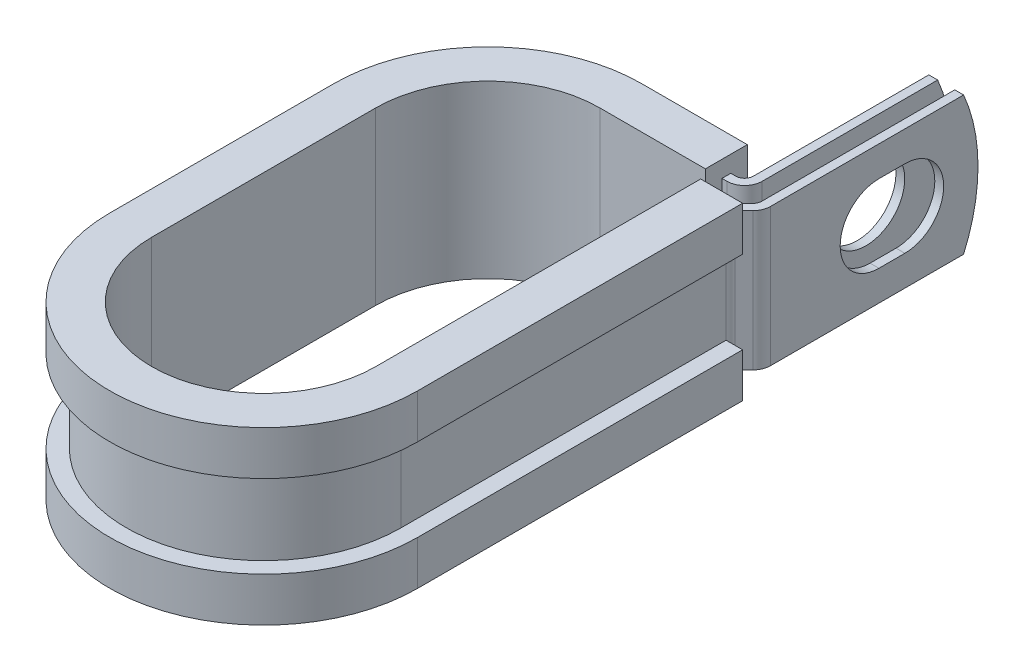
from build123d import *

# Parameters (mm, degrees)
EXTRUDE_THIN1_DEPTH = 6.35
SKETCH2_R           = 3.5687
CUT_EXTRUDE1_DEPTH  = 0.8128
CUT_EXTRUDE2_DEPTH  = 0.8128
CUT_EXTRUDE3_DEPTH  = 42.306831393


with BuildPart() as part:
    # Sketch1 → Extrude-Thin1 (new, symmetric)
    with BuildSketch(Plane(origin=(0, 0, 0), x_dir=(1, 0, 0), z_dir=(0, 1, 0))):
        with BuildLine():
            Line((13.376774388, 30.9372), (13.376774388, 11.8364))
            ThreePointArc((13.376774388, 11.8364), (13.314903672, 11.525354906), (13.13871078, 11.261663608))
            Line((13.13871078, 11.261663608), (12.312527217, 10.435480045))
            ThreePointArc((12.312527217, 10.435480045), (11.960141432, 9.908097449), (11.8364, 9.286007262))
            Line((11.8364, 9.286007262), (11.8364, 0))
            Line((11.8364, 0), (11.8364, -20.6248))
            ThreePointArc((11.8364, -20.6248), (0, -32.4612), (-11.8364, -20.6248))
            Line((-11.8364, -20.6248), (-11.8364, 0))
            ThreePointArc((-11.8364, 0), (-8.369598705, 8.369598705), (0, 11.8364))
            Line((0, 11.8364), (10.176374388, 11.8364))
            ThreePointArc((10.176374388, 11.8364), (11.325847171, 12.312527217), (11.801974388, 13.462))
            Line((11.801974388, 13.462), (11.801974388, 30.9372))
            Line((11.801974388, 30.9372), (10.989174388, 30.9372))
            Line((10.989174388, 30.9372), (10.989174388, 13.462))
            ThreePointArc((10.989174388, 13.462), (10.75111078, 12.887263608), (10.176374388, 12.6492))
            Line((10.176374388, 12.6492), (0, 12.6492))
            ThreePointArc((0, 12.6492), (-8.944335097, 8.944335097), (-12.6492, 0))
            Line((-12.6492, 0), (-12.6492, -20.6248))
            ThreePointArc((-12.6492, -20.6248), (0, -33.274), (12.6492, -20.6248))
            Line((12.6492, -20.6248), (12.6492, 0))
            Line((12.6492, 0), (12.6492, 9.286007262))
            ThreePointArc((12.6492, 9.286007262), (12.711070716, 9.597052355), (12.887263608, 9.860743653))
            Line((12.887263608, 9.860743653), (13.713447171, 10.686927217))
            ThreePointArc((13.713447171, 10.686927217), (14.065832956, 11.214309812), (14.189574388, 11.8364))
            Line((14.189574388, 11.8364), (14.189574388, 30.9372))
            Line((14.189574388, 30.9372), (13.376774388, 30.9372))
        make_face()
    extrude(amount=EXTRUDE_THIN1_DEPTH, both=True)

    # Sketch2 → Cut-Extrude1 (cut)
    with BuildSketch(Plane.ZY.offset(-10.989174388)):
        with Locations((-23.0124, 0)):
            Circle(SKETCH2_R)
    extrude(amount=-CUT_EXTRUDE1_DEPTH, mode=Mode.SUBTRACT)

    # Sketch3 → Cut-Extrude2 (cut)
    with BuildSketch(Plane(origin=(14.189574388, 0, 0), x_dir=(0, 0, -1), z_dir=(1, 0, 0))):
        with BuildLine():
            Line((21.8186, 3.5687), (24.2062, 3.5687))
            ThreePointArc((24.2062, 3.5687), (27.7749, 0), (24.2062, -3.5687))
            Line((24.2062, -3.5687), (21.8186, -3.5687))
            ThreePointArc((21.8186, -3.5687), (18.2499, 0), (21.8186, 3.5687))
        make_face()
    extrude(amount=-CUT_EXTRUDE2_DEPTH, mode=Mode.SUBTRACT)

    # Sketch4 → Cut-Extrude3 (cut, through all)
    with BuildSketch(Plane.ZY.offset(-10.989174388)):
        with BuildLine():
            Line((-29.611877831, 6.35), (-30.9372, 6.35))
            Line((-30.9372, 6.35), (-30.9372, -8.8e-08))
            ThreePointArc((-30.9372, -8.8e-08), (-30.602337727, 3.24341555), (-29.611877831, 6.35))
        make_face()
        with BuildLine():
            ThreePointArc((-29.611877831, -6.35), (-30.602337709, -3.243415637), (-30.9372, -8.8e-08))
            Line((-30.9372, -8.8e-08), (-30.9372, -6.35))
            Line((-30.9372, -6.35), (-29.611877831, -6.35))
        make_face()
    extrude(amount=-CUT_EXTRUDE3_DEPTH, mode=Mode.SUBTRACT)

    # Sweep1: sweep along a path in Sketch6
    with BuildLine(Plane(origin=(0, 6.35, 0), x_dir=(1, 0, 0), z_dir=(0, 1, 0))) as sweep1_path:
        Line((10.3124, 9.286007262), (10.3124, 0))
        Line((10.3124, 0), (10.3124, -20.6248))
        ThreePointArc((10.3124, -20.6248), (0, -30.9372), (-10.3124, -20.6248))
        Line((-10.3124, -20.6248), (-10.3124, 0))
        ThreePointArc((-10.3124, 0), (-7.29196797, 7.29196797), (0, 10.3124))
        Line((0, 10.3124), (9.719174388, 10.3124))
    # Sketch5 → Sweep1 (sweep)
    with BuildSketch(Plane(origin=(0, 0, -9.286007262), x_dir=(-1, 0, 0), z_dir=(0, 0, -1))):
        Polygon((-12.6492, 6.35), (-11.8364, 6.35), (-11.8364, -6.35), (-12.6492, -6.35), (-12.6492, -3.81), (-14.1732, -3.81), (-14.1732, -7.874), (-10.3124, -7.874), (-10.3124, 7.874), (-14.1732, 7.874), (-14.1732, 3.81), (-12.6492, 3.81), align=None)
    sweep(path=sweep1_path.line)


solid = part.part
